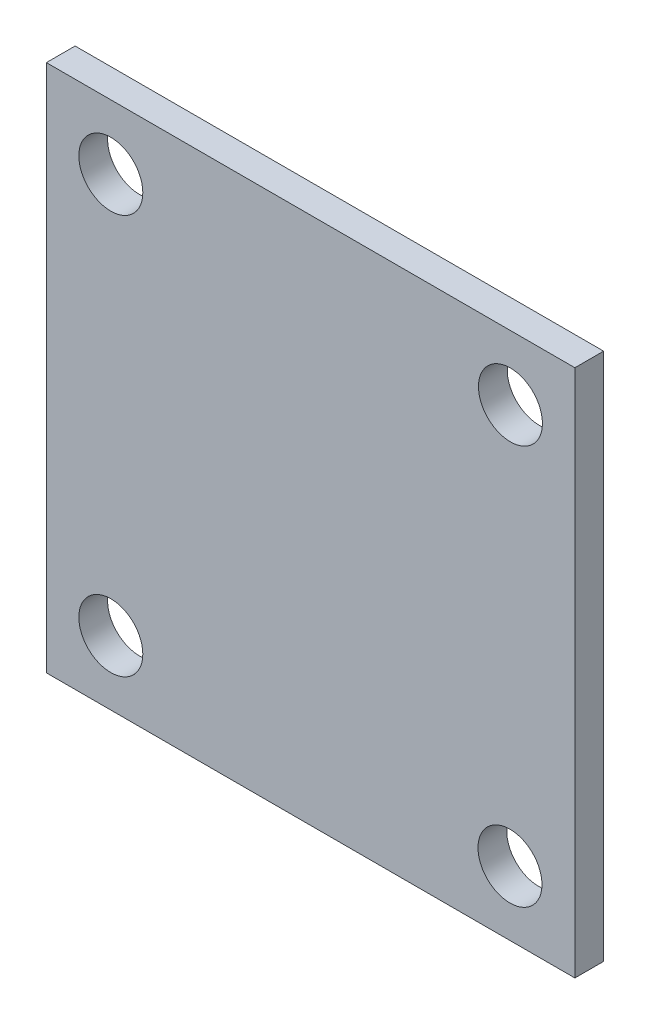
ISO-10303-21;
HEADER;
FILE_DESCRIPTION(('STEP AP214'),'2;1');
FILE_NAME('part.step','',(''),(''),'','','');
FILE_SCHEMA(('AUTOMOTIVE_DESIGN { 1 0 10303 214 1 1 1 1 }'));
ENDSEC;
DATA;
#1=APPLICATION_CONTEXT('core data for automotive mechanical design processes');
#2=APPLICATION_PROTOCOL_DEFINITION('international standard','automotive_design',2000,#1);
#3=PRODUCT_CONTEXT('',#1,'mechanical');
#4=PRODUCT('Part','Part','',(#3));
#5=PRODUCT_RELATED_PRODUCT_CATEGORY('part','',(#4));
#6=PRODUCT_DEFINITION_FORMATION('','',#4);
#7=PRODUCT_DEFINITION_CONTEXT('part definition',#1,'design');
#8=PRODUCT_DEFINITION('design','',#6,#7);
#9=PRODUCT_DEFINITION_SHAPE('','',#8);
#10=(LENGTH_UNIT() NAMED_UNIT(*) SI_UNIT(.MILLI.,.METRE.));
#11=(NAMED_UNIT(*) PLANE_ANGLE_UNIT() SI_UNIT($,.RADIAN.));
#12=(NAMED_UNIT(*) SI_UNIT($,.STERADIAN.) SOLID_ANGLE_UNIT());
#13=UNCERTAINTY_MEASURE_WITH_UNIT(LENGTH_MEASURE(1.E-05),#10,'distance_accuracy_value','');
#14=(GEOMETRIC_REPRESENTATION_CONTEXT(3) GLOBAL_UNCERTAINTY_ASSIGNED_CONTEXT((#13)) GLOBAL_UNIT_ASSIGNED_CONTEXT((#10,
#11,#12)) REPRESENTATION_CONTEXT('',''));
#15=CARTESIAN_POINT('',(0.,0.,0.));
#16=DIRECTION('',(0.,0.,1.));
#17=DIRECTION('',(1.,0.,0.));
#18=AXIS2_PLACEMENT_3D('',#15,#16,#17);
#19=CARTESIAN_POINT('',(46.2788,134.010399,1.5748));
#20=DIRECTION('',(0.,-1.,0.));
#21=DIRECTION('',(0.,0.,-1.));
#22=AXIS2_PLACEMENT_3D('',#19,#20,#21);
#23=PLANE('',#22);
#24=DIRECTION('',(0.,0.,1.));
#25=VECTOR('',#24,1.);
#26=CARTESIAN_POINT('',(46.2788,134.010399,0.7874));
#27=LINE('',#26,#25);
#28=CARTESIAN_POINT('',(46.2788,134.010399,0.));
#29=VERTEX_POINT('',#28);
#30=CARTESIAN_POINT('',(46.2788,134.010399,1.5748));
#31=VERTEX_POINT('',#30);
#32=EDGE_CURVE('E69',#29,#31,#27,.T.);
#33=ORIENTED_EDGE('',*,*,#32,.F.);
#34=DIRECTION('',(1.,0.,0.));
#35=VECTOR('',#34,1.);
#36=CARTESIAN_POINT('',(60.7568,134.010399,0.));
#37=LINE('',#36,#35);
#38=CARTESIAN_POINT('',(75.2348,134.010399,0.));
#39=VERTEX_POINT('',#38);
#40=EDGE_CURVE('E85',#29,#39,#37,.T.);
#41=ORIENTED_EDGE('',*,*,#40,.T.);
#42=DIRECTION('',(0.,0.,-1.));
#43=VECTOR('',#42,1.);
#44=CARTESIAN_POINT('',(75.2348,134.010399,0.7874));
#45=LINE('',#44,#43);
#46=CARTESIAN_POINT('',(75.2348,134.010399,1.5748));
#47=VERTEX_POINT('',#46);
#48=EDGE_CURVE('E84',#47,#39,#45,.T.);
#49=ORIENTED_EDGE('',*,*,#48,.F.);
#50=DIRECTION('',(1.,0.,0.));
#51=VECTOR('',#50,1.);
#52=CARTESIAN_POINT('',(60.7568,134.010399,1.5748));
#53=LINE('',#52,#51);
#54=EDGE_CURVE('E74',#31,#47,#53,.T.);
#55=ORIENTED_EDGE('',*,*,#54,.F.);
#56=EDGE_LOOP('',(#33,#41,#49,#55));
#57=FACE_BOUND('',#56,.T.);
#58=ADVANCED_FACE('F31',(#57),#23,.T.);
#59=CARTESIAN_POINT('',(75.2348,134.010399,1.5748));
#60=DIRECTION('',(1.,0.,0.));
#61=DIRECTION('',(0.,0.,-1.));
#62=AXIS2_PLACEMENT_3D('',#59,#60,#61);
#63=PLANE('',#62);
#64=ORIENTED_EDGE('',*,*,#48,.T.);
#65=DIRECTION('',(0.,1.,0.));
#66=VECTOR('',#65,1.);
#67=CARTESIAN_POINT('',(75.2348,148.488399,0.));
#68=LINE('',#67,#66);
#69=CARTESIAN_POINT('',(75.2348,162.966399,0.));
#70=VERTEX_POINT('',#69);
#71=EDGE_CURVE('E158',#39,#70,#68,.T.);
#72=ORIENTED_EDGE('',*,*,#71,.T.);
#73=DIRECTION('',(0.,0.,-1.));
#74=VECTOR('',#73,1.);
#75=CARTESIAN_POINT('',(75.2348,162.966399,0.7874));
#76=LINE('',#75,#74);
#77=CARTESIAN_POINT('',(75.2348,162.966399,1.5748));
#78=VERTEX_POINT('',#77);
#79=EDGE_CURVE('E89',#78,#70,#76,.T.);
#80=ORIENTED_EDGE('',*,*,#79,.F.);
#81=DIRECTION('',(0.,1.,0.));
#82=VECTOR('',#81,1.);
#83=CARTESIAN_POINT('',(75.2348,148.488399,1.5748));
#84=LINE('',#83,#82);
#85=EDGE_CURVE('E78',#47,#78,#84,.T.);
#86=ORIENTED_EDGE('',*,*,#85,.F.);
#87=EDGE_LOOP('',(#64,#72,#80,#86));
#88=FACE_BOUND('',#87,.T.);
#89=ADVANCED_FACE('F91',(#88),#63,.T.);
#90=CARTESIAN_POINT('',(75.2348,162.966399,1.5748));
#91=DIRECTION('',(0.,1.,0.));
#92=DIRECTION('',(0.,0.,-1.));
#93=AXIS2_PLACEMENT_3D('',#90,#91,#92);
#94=PLANE('',#93);
#95=ORIENTED_EDGE('',*,*,#79,.T.);
#96=DIRECTION('',(-1.,0.,0.));
#97=VECTOR('',#96,1.);
#98=CARTESIAN_POINT('',(60.7568,162.966399,0.));
#99=LINE('',#98,#97);
#100=CARTESIAN_POINT('',(46.2788,162.966399,0.));
#101=VERTEX_POINT('',#100);
#102=EDGE_CURVE('E160',#70,#101,#99,.T.);
#103=ORIENTED_EDGE('',*,*,#102,.T.);
#104=DIRECTION('',(0.,0.,-1.));
#105=VECTOR('',#104,1.);
#106=CARTESIAN_POINT('',(46.2788,162.966399,0.7874));
#107=LINE('',#106,#105);
#108=CARTESIAN_POINT('',(46.2788,162.966399,1.5748));
#109=VERTEX_POINT('',#108);
#110=EDGE_CURVE('E50',#109,#101,#107,.T.);
#111=ORIENTED_EDGE('',*,*,#110,.F.);
#112=DIRECTION('',(-1.,0.,0.));
#113=VECTOR('',#112,1.);
#114=CARTESIAN_POINT('',(60.7568,162.966399,1.5748));
#115=LINE('',#114,#113);
#116=EDGE_CURVE('E93',#78,#109,#115,.T.);
#117=ORIENTED_EDGE('',*,*,#116,.F.);
#118=EDGE_LOOP('',(#95,#103,#111,#117));
#119=FACE_BOUND('',#118,.T.);
#120=ADVANCED_FACE('F172',(#119),#94,.T.);
#121=CARTESIAN_POINT('',(46.2788,162.966399,1.5748));
#122=DIRECTION('',(-1.,0.,0.));
#123=DIRECTION('',(0.,0.,-1.));
#124=AXIS2_PLACEMENT_3D('',#121,#122,#123);
#125=PLANE('',#124);
#126=ORIENTED_EDGE('',*,*,#110,.T.);
#127=DIRECTION('',(0.,-1.,0.));
#128=VECTOR('',#127,1.);
#129=CARTESIAN_POINT('',(46.2788,148.488399,0.));
#130=LINE('',#129,#128);
#131=EDGE_CURVE('E148',#101,#29,#130,.T.);
#132=ORIENTED_EDGE('',*,*,#131,.T.);
#133=ORIENTED_EDGE('',*,*,#32,.T.);
#134=DIRECTION('',(0.,-1.,0.));
#135=VECTOR('',#134,1.);
#136=CARTESIAN_POINT('',(46.2788,148.488399,1.5748));
#137=LINE('',#136,#135);
#138=EDGE_CURVE('E80',#109,#31,#137,.T.);
#139=ORIENTED_EDGE('',*,*,#138,.F.);
#140=EDGE_LOOP('',(#126,#132,#133,#139));
#141=FACE_BOUND('',#140,.T.);
#142=ADVANCED_FACE('F124',(#141),#125,.T.);
#143=CARTESIAN_POINT('',(51.562,159.4358,1.5748));
#144=CARTESIAN_POINT('',(51.562,159.4358,0.));
#145=B_SPLINE_CURVE_WITH_KNOTS('',1,(#143,#144),.UNSPECIFIED.,.F.,.F.,(2,2),(0.,1.),.UNSPECIFIED.);
#146=CARTESIAN_POINT('',(49.8094,159.4358,0.));
#147=DIRECTION('',(0.,0.,1.));
#148=AXIS1_PLACEMENT('',#146,#147);
#149=SURFACE_OF_REVOLUTION('',#145,#148);
#150=CARTESIAN_POINT('',(49.8094,159.4358,1.5748));
#151=DIRECTION('',(0.,0.,1.));
#152=DIRECTION('',(1.,0.,0.));
#153=AXIS2_PLACEMENT_3D('',#150,#151,#152);
#154=CIRCLE('',#153,1.75260000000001);
#155=CARTESIAN_POINT('',(51.562,159.4358,1.5748));
#156=VERTEX_POINT('',#155);
#157=EDGE_CURVE('E35',#156,#156,#154,.T.);
#158=ORIENTED_EDGE('',*,*,#157,.T.);
#159=EDGE_LOOP('',(#158));
#160=FACE_BOUND('',#159,.T.);
#161=CARTESIAN_POINT('',(49.8094,159.4358,0.));
#162=DIRECTION('',(0.,0.,1.));
#163=DIRECTION('',(1.,0.,0.));
#164=AXIS2_PLACEMENT_3D('',#161,#162,#163);
#165=CIRCLE('',#164,1.75260000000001);
#166=CARTESIAN_POINT('',(51.562,159.4358,0.));
#167=VERTEX_POINT('',#166);
#168=EDGE_CURVE('E145',#167,#167,#165,.T.);
#169=ORIENTED_EDGE('',*,*,#168,.F.);
#170=EDGE_LOOP('',(#169));
#171=FACE_BOUND('',#170,.T.);
#172=ADVANCED_FACE('F120',(#160,#171),#149,.T.);
#173=CARTESIAN_POINT('',(73.4314,137.541,1.5748));
#174=CARTESIAN_POINT('',(73.4314,137.541,0.));
#175=B_SPLINE_CURVE_WITH_KNOTS('',1,(#173,#174),.UNSPECIFIED.,.F.,.F.,(2,2),(0.,1.),.UNSPECIFIED.);
#176=CARTESIAN_POINT('',(71.6788,137.541,0.));
#177=DIRECTION('',(0.,0.,1.));
#178=AXIS1_PLACEMENT('',#176,#177);
#179=SURFACE_OF_REVOLUTION('',#175,#178);
#180=CARTESIAN_POINT('',(71.6788,137.541,1.5748));
#181=DIRECTION('',(0.,0.,1.));
#182=DIRECTION('',(1.,0.,0.));
#183=AXIS2_PLACEMENT_3D('',#180,#181,#182);
#184=CIRCLE('',#183,1.75260000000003);
#185=CARTESIAN_POINT('',(73.4314,137.541,1.5748));
#186=VERTEX_POINT('',#185);
#187=EDGE_CURVE('E151',#186,#186,#184,.T.);
#188=ORIENTED_EDGE('',*,*,#187,.T.);
#189=EDGE_LOOP('',(#188));
#190=FACE_BOUND('',#189,.T.);
#191=CARTESIAN_POINT('',(71.6788,137.541,0.));
#192=DIRECTION('',(0.,0.,1.));
#193=DIRECTION('',(1.,0.,0.));
#194=AXIS2_PLACEMENT_3D('',#191,#192,#193);
#195=CIRCLE('',#194,1.75260000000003);
#196=CARTESIAN_POINT('',(73.4314,137.541,0.));
#197=VERTEX_POINT('',#196);
#198=EDGE_CURVE('E142',#197,#197,#195,.T.);
#199=ORIENTED_EDGE('',*,*,#198,.F.);
#200=EDGE_LOOP('',(#199));
#201=FACE_BOUND('',#200,.T.);
#202=ADVANCED_FACE('F114',(#190,#201),#179,.T.);
#203=CARTESIAN_POINT('',(73.4568,159.4358,1.5748));
#204=CARTESIAN_POINT('',(73.4568,159.4358,0.));
#205=B_SPLINE_CURVE_WITH_KNOTS('',1,(#203,#204),.UNSPECIFIED.,.F.,.F.,(2,2),(0.,1.),.UNSPECIFIED.);
#206=CARTESIAN_POINT('',(71.7042,159.4358,0.));
#207=DIRECTION('',(0.,0.,1.));
#208=AXIS1_PLACEMENT('',#206,#207);
#209=SURFACE_OF_REVOLUTION('',#205,#208);
#210=CARTESIAN_POINT('',(71.7042,159.4358,1.5748));
#211=DIRECTION('',(0.,0.,1.));
#212=DIRECTION('',(1.,0.,0.));
#213=AXIS2_PLACEMENT_3D('',#210,#211,#212);
#214=CIRCLE('',#213,1.7526);
#215=CARTESIAN_POINT('',(73.4568,159.4358,1.5748));
#216=VERTEX_POINT('',#215);
#217=EDGE_CURVE('E149',#216,#216,#214,.T.);
#218=ORIENTED_EDGE('',*,*,#217,.T.);
#219=EDGE_LOOP('',(#218));
#220=FACE_BOUND('',#219,.T.);
#221=CARTESIAN_POINT('',(71.7042,159.4358,0.));
#222=DIRECTION('',(0.,0.,1.));
#223=DIRECTION('',(1.,0.,0.));
#224=AXIS2_PLACEMENT_3D('',#221,#222,#223);
#225=CIRCLE('',#224,1.75259999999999);
#226=CARTESIAN_POINT('',(73.4568,159.4358,0.));
#227=VERTEX_POINT('',#226);
#228=EDGE_CURVE('E139',#227,#227,#225,.T.);
#229=ORIENTED_EDGE('',*,*,#228,.F.);
#230=EDGE_LOOP('',(#229));
#231=FACE_BOUND('',#230,.T.);
#232=ADVANCED_FACE('F110',(#220,#231),#209,.T.);
#233=CARTESIAN_POINT('',(46.2788,134.010399,1.5748));
#234=DIRECTION('',(0.,0.,1.));
#235=DIRECTION('',(1.,0.,0.));
#236=AXIS2_PLACEMENT_3D('',#233,#234,#235);
#237=PLANE('',#236);
#238=ORIENTED_EDGE('',*,*,#217,.F.);
#239=EDGE_LOOP('',(#238));
#240=FACE_BOUND('',#239,.T.);
#241=ORIENTED_EDGE('',*,*,#187,.F.);
#242=EDGE_LOOP('',(#241));
#243=FACE_BOUND('',#242,.T.);
#244=ORIENTED_EDGE('',*,*,#157,.F.);
#245=EDGE_LOOP('',(#244));
#246=FACE_BOUND('',#245,.T.);
#247=CARTESIAN_POINT('',(49.8094,137.541,1.5748));
#248=DIRECTION('',(0.,0.,1.));
#249=DIRECTION('',(1.,0.,0.));
#250=AXIS2_PLACEMENT_3D('',#247,#248,#249);
#251=CIRCLE('',#250,1.7526);
#252=CARTESIAN_POINT('',(51.562,137.541,1.5748));
#253=VERTEX_POINT('',#252);
#254=EDGE_CURVE('E41',#253,#253,#251,.F.);
#255=ORIENTED_EDGE('',*,*,#254,.T.);
#256=EDGE_LOOP('',(#255));
#257=FACE_BOUND('',#256,.T.);
#258=ORIENTED_EDGE('',*,*,#116,.T.);
#259=ORIENTED_EDGE('',*,*,#138,.T.);
#260=ORIENTED_EDGE('',*,*,#54,.T.);
#261=ORIENTED_EDGE('',*,*,#85,.T.);
#262=EDGE_LOOP('',(#258,#259,#260,#261));
#263=FACE_BOUND('',#262,.T.);
#264=ADVANCED_FACE('F76',(#240,#243,#246,#257,#263),#237,.T.);
#265=CARTESIAN_POINT('',(46.2788,134.010399,0.));
#266=DIRECTION('',(0.,0.,1.));
#267=DIRECTION('',(1.,0.,0.));
#268=AXIS2_PLACEMENT_3D('',#265,#266,#267);
#269=PLANE('',#268);
#270=ORIENTED_EDGE('',*,*,#228,.T.);
#271=EDGE_LOOP('',(#270));
#272=FACE_BOUND('',#271,.T.);
#273=ORIENTED_EDGE('',*,*,#198,.T.);
#274=EDGE_LOOP('',(#273));
#275=FACE_BOUND('',#274,.T.);
#276=ORIENTED_EDGE('',*,*,#168,.T.);
#277=EDGE_LOOP('',(#276));
#278=FACE_BOUND('',#277,.T.);
#279=CARTESIAN_POINT('',(49.8094,137.541,0.));
#280=DIRECTION('',(0.,0.,1.));
#281=DIRECTION('',(1.,0.,0.));
#282=AXIS2_PLACEMENT_3D('',#279,#280,#281);
#283=CIRCLE('',#282,1.75260000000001);
#284=CARTESIAN_POINT('',(51.562,137.541,0.));
#285=VERTEX_POINT('',#284);
#286=EDGE_CURVE('E11',#285,#285,#283,.T.);
#287=ORIENTED_EDGE('',*,*,#286,.T.);
#288=EDGE_LOOP('',(#287));
#289=FACE_BOUND('',#288,.T.);
#290=ORIENTED_EDGE('',*,*,#102,.F.);
#291=ORIENTED_EDGE('',*,*,#71,.F.);
#292=ORIENTED_EDGE('',*,*,#40,.F.);
#293=ORIENTED_EDGE('',*,*,#131,.F.);
#294=EDGE_LOOP('',(#290,#291,#292,#293));
#295=FACE_BOUND('',#294,.T.);
#296=ADVANCED_FACE('F33',(#272,#275,#278,#289,#295),#269,.F.);
#297=CARTESIAN_POINT('',(51.562,137.541,1.5748));
#298=CARTESIAN_POINT('',(51.562,137.541,0.));
#299=B_SPLINE_CURVE_WITH_KNOTS('',1,(#297,#298),.UNSPECIFIED.,.F.,.F.,(2,2),(0.,1.),.UNSPECIFIED.);
#300=CARTESIAN_POINT('',(49.8094,137.541,0.));
#301=DIRECTION('',(0.,0.,1.));
#302=AXIS1_PLACEMENT('',#300,#301);
#303=SURFACE_OF_REVOLUTION('',#299,#302);
#304=ORIENTED_EDGE('',*,*,#254,.F.);
#305=EDGE_LOOP('',(#304));
#306=FACE_BOUND('',#305,.T.);
#307=ORIENTED_EDGE('',*,*,#286,.F.);
#308=EDGE_LOOP('',(#307));
#309=FACE_BOUND('',#308,.T.);
#310=ADVANCED_FACE('F116',(#306,#309),#303,.T.);
#311=CLOSED_SHELL('',(#58,#89,#120,#142,#172,#202,#232,#264,#296,#310));
#312=MANIFOLD_SOLID_BREP('B2',#311);
#313=ADVANCED_BREP_SHAPE_REPRESENTATION('',(#18,#312),#14);
#314=SHAPE_DEFINITION_REPRESENTATION(#9,#313);
ENDSEC;
END-ISO-10303-21;
